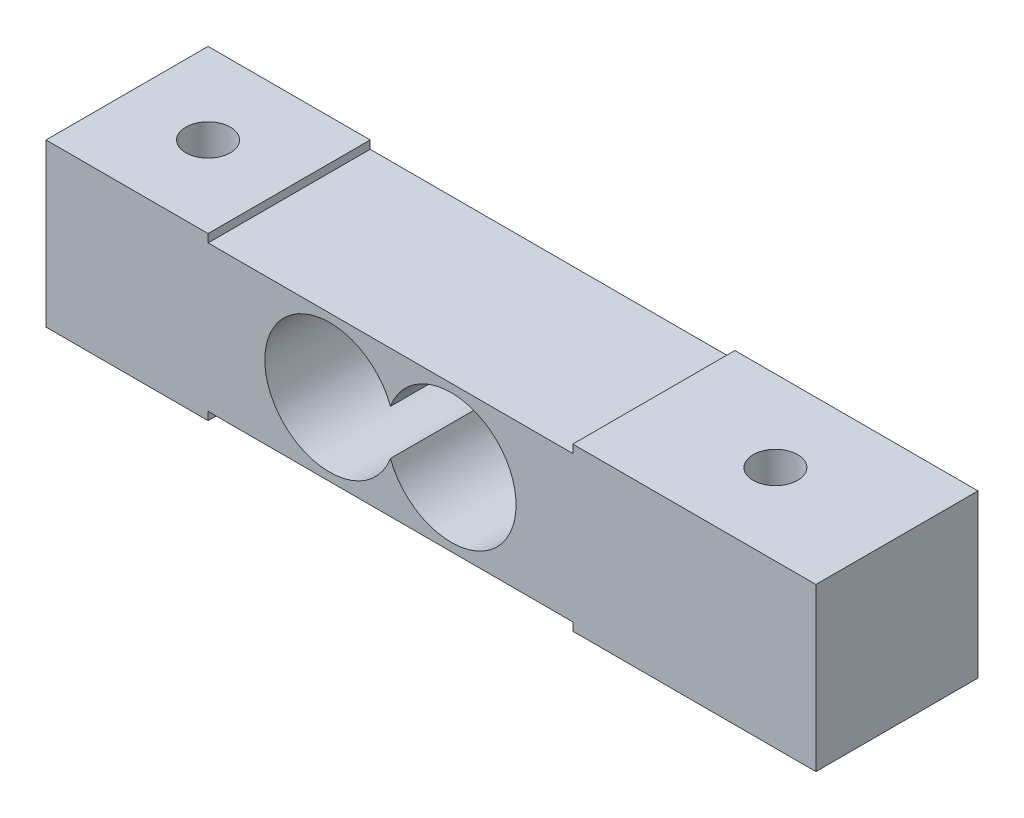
from build123d import *

# Parameters (mm, degrees)
EXTRUSION1_DEPTH        = 20
ESQUISSE2_R             = 2.75
ENL_V_MAT_EXTRU_1_DEPTH = 20
ESQUISSE3_R             = 2.75
ENL_V_MAT_EXTRU_2_DEPTH = 5
ESQUISSE4_R             = 2.5
ENL_V_MAT_EXTRU_3_DEPTH = 99.234413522


with BuildPart() as part:
    # Esquisse1 → Extrusion1 (new body)
    with BuildSketch(Plane.XY):
        Polygon((20, 0), (20, -1), (65, -1), (65, 0), (95, 0), (95, -20), (65, -20), (65, -19), (20, -19), (20, -20), (0, -20), (0, 0), align=None)
        with BuildLine():
            ThreePointArc((42.5, -7.216117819), (27, -10), (42.5, -12.783882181))
            ThreePointArc((42.5, -12.783882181), (58, -10), (42.5, -7.216117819))
        make_face(mode=Mode.SUBTRACT)
    extrude(amount=EXTRUSION1_DEPTH)

    # Esquisse2 → Enl_v. mat.-Extru.1 (cut)
    with BuildSketch(Plane(origin=(0, 0, 0), x_dir=(-1, 0, 0), z_dir=(0, 1, 0))):
        with Locations(Location((-10, 10, 0), (0, 0, 90))):
            Circle(ESQUISSE2_R)
    extrude(amount=-ENL_V_MAT_EXTRU_1_DEPTH, mode=Mode.SUBTRACT)

    # Esquisse3 → Enl_v. mat.-Extru.2 (cut)
    with BuildSketch(Plane(origin=(0, 0, 0), x_dir=(-1, 0, 0), z_dir=(0, 1, 0))):
        with Locations(Location((-80, 10, 0), (0, 0, 90))):
            Circle(ESQUISSE3_R)
    extrude(amount=-ENL_V_MAT_EXTRU_2_DEPTH, mode=Mode.SUBTRACT)

    # Esquisse4 → Enl_v. mat.-Extru.3 (cut, through all)
    with BuildSketch(Plane(origin=(0, -5, 0), x_dir=(-1, 0, 0), z_dir=(0, 1, 0))):
        with Locations(Location((-80, 10, 0), (0, 0, 90))):
            Circle(ESQUISSE4_R)
    extrude(amount=-ENL_V_MAT_EXTRU_3_DEPTH, mode=Mode.SUBTRACT)


solid = part.part
